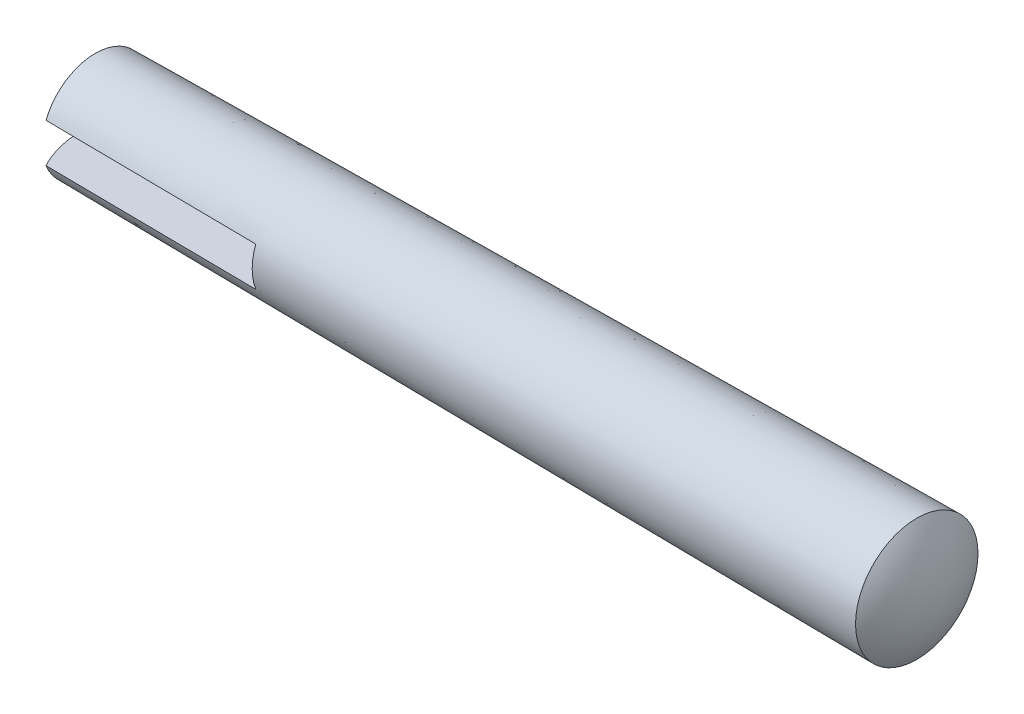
from build123d import *

# Parameters (mm, degrees)
SPLIT_2_DEPTH      = 10
SPLIT_2_DEPTH_BACK = 40.867646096
SPLSKE_W           = 5.7748
SPLSKE_H           = 1.850215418


with BuildPart() as part:
    # BodySke → Body (revolve)
    with BuildSketch(Plane.XY, mode=Mode.PRIVATE) as body_sk:
        with BuildLine():
            Line((0, 2.5), (38.74, 2.8874))
            ThreePointArc((38.74, 2.8874), (39.422958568, 1.514905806), (39.65797584, 0))
            Line((39.65797584, 0), (-0.669872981, 0))
            ThreePointArc((-0.669872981, 0), (-0.499502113, 1.294095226), (0, 2.5))
        make_face()
    revolve(body_sk.sketch.rotate(Axis((-0.669872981, 0, 0), (1, 0, 0)), 90), axis=Axis((-0.669872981, 0, 0), (1, 0, 0)))

    # SplSke → Split 2 (cut, two sides: drawn at the far end of the back side and taken through both)
    with BuildSketch(Plane(origin=(0, 0, 0), x_dir=(0, 0, -1), z_dir=(1, 0, 0)).offset(-SPLIT_2_DEPTH_BACK)):
        Rectangle(SPLSKE_W, SPLSKE_H)
    extrude(amount=SPLIT_2_DEPTH + SPLIT_2_DEPTH_BACK, mode=Mode.SUBTRACT)


solid = part.part
